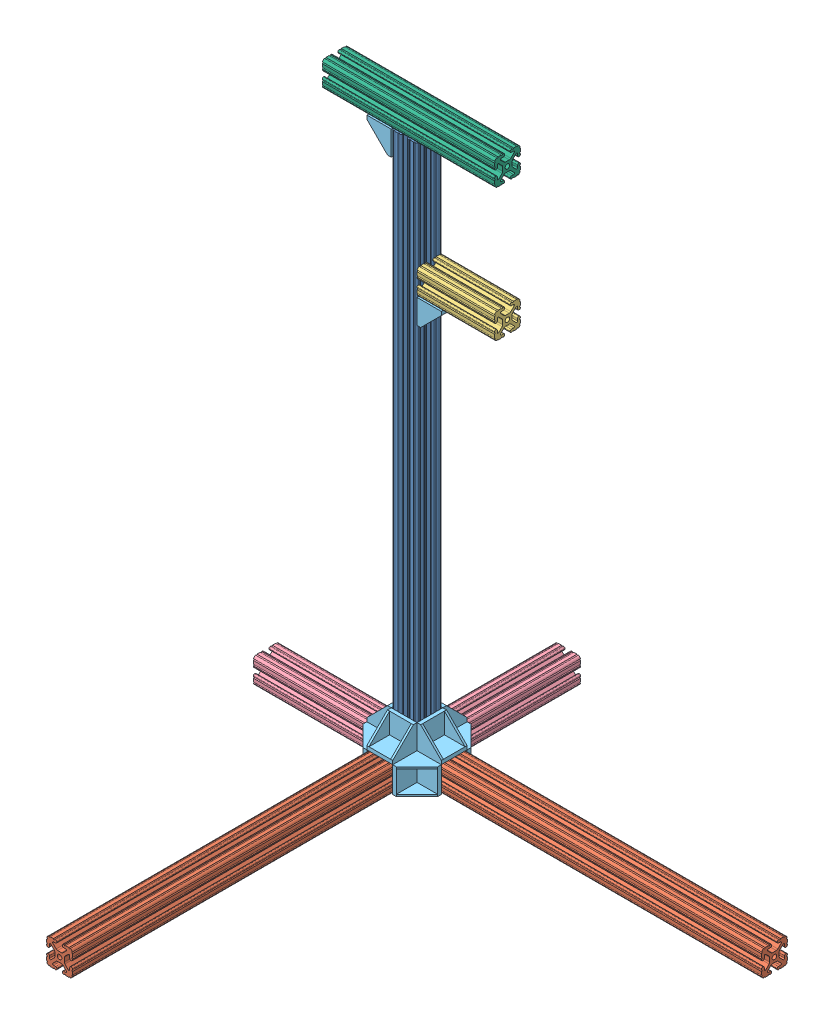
SolidWorks assembly Spine Assembly.SLDASM, configuration Default (file format 15000). Lengths in mm.
Overall size (749.3 850.9 749.3).
17 component instances, 6 part files, 59 mates.
Components (placement in the parent):
- 32in8020-1: 32in8020.SLDPRT [47065T415] at (-19.05 355.6 -19.05) x (1 0 0) z (0 -1 0) size (38.1 38.1 812.8)
- 20in8020-1: 20in8020.SLDPRT [47065T415] at (-19.05 19.05 457.2) size (38.1 38.1 508)
- 20in8020-2: 20in8020.SLDPRT [47065T415] at (50.8 19.05 -19.05) x (0 0 1) z (-1 0 0) size (38.1 38.1 508)
- 4.5in8020-3: 4.5in8020.SLDPRT [47065T415] at (-342.9 636.016 -19.05) x (0 0 1) z (-1 0 0) size (38.1 38.1 114.3)
- 8in8020-3: 8in8020.SLDPRT [47065T415] at (-19.05 19.05 215.9) size (38.1 38.1 203.2)
- 8in8020-4: 8in8020.SLDPRT [47065T415] at (215.9 19.05 -19.05) x (0 0 -1) z (1 0 0) size (38.1 38.1 203.2)
- Corner Support-1: Corner Support.SLDPRT [Default] at (0 616.966 0) x (0 0 -1) z (1 0 0) size (38.1 35.81 35.81)
- Corner Support-2: Corner Support.SLDPRT [Default] at (0 0 -38.1) x (0 1 0) z (1 0 0) size (38.1 35.81 35.81)
- Corner Support-3: Corner Support.SLDPRT [Default] at (-38.1 0 0) x (0 1 0) z (-1 0 0) size (38.1 35.81 35.81)
- Corner Support-4: Corner Support.SLDPRT [Default] x (0 1 0) z (0 0 1) size (38.1 35.81 35.81)
- Corner Support-5: Corner Support.SLDPRT [Default] at (0 38.1 -38.1) x (-1 0 0) z (0 1 0) size (38.1 35.81 35.81)
- Corner Support-6: Corner Support.SLDPRT [Default] at (0 38.1 0) x (0 0 -1) z (0 1 0) size (38.1 35.81 35.81)
- Corner Support-7: Corner Support.SLDPRT [Default] at (-38.1 38.1 0) x (1 0 0) z (0 1 0) size (38.1 35.81 35.81)
- Corner Support-8: Corner Support.SLDPRT [Default] at (-38.1 0 -38.1) x (0 1 0) z (0 0 -1) size (38.1 35.81 35.81)
- Corner Support-9: Corner Support.SLDPRT [Default] at (-38.1 38.1 -38.1) x (0 0 1) z (0 1 0) size (38.1 35.81 35.81)
- Corner Support-10: Corner Support.SLDPRT [Default] at (-38.1 812.8 -38.1) x (0 0 1) z (-1 0 0) size (38.1 35.81 35.81)
- 10in8020-1: 10in8020.SLDPRT [47065T415] at (317.5 831.85 -19.05) x (0 0 -1) z (1 0 0) size (38.1 38.1 254)
Mates (geometry in assembly coordinates):
- Coincident1: coincident aligned: plane of 32in8020-1 through (0 -101.6 -13.2588) normal (1 0 0)
- Coincident2: coincident aligned: plane of 32in8020-1 through (-24.8412 -101.6 0) normal (0 0 1)
- Coincident3: coincident anti-aligned: plane of 32in8020-1 through (-13.2588 0 -36.3728) normal (0 -1 0)
- Coincident4: coincident aligned: plane of 32in8020-1 through (-13.2588 0 -36.3728) normal (0 -1 0); plane of 20in8020-1 through (-13.2588 0 914.4) normal (0 -1 0)
- Coincident5: coincident aligned: plane of 20in8020-1 through (-13.2588 0 914.4) normal (0 -1 0); plane of 20in8020-2 through (-406.4 0 -13.2588) normal (0 -1 0)
- Coincident6: coincident anti-aligned: plane of 32in8020-1 through (-24.8412 -101.6 0) normal (0 0 1); plane of 20in8020-1 through (-13.2588 1.7272 0) normal (0 0 -1)
- Coincident7: coincident aligned: plane of 32in8020-1 through (0 -101.6 -13.2588) normal (1 0 0); plane of 20in8020-1 through (0 24.8412 914.4) normal (1 0 0)
- Coincident8: coincident anti-aligned: plane of 32in8020-1 through (0 -101.6 -24.8412) normal (1 0 0); plane of 20in8020-2 through (0 1.7272 -13.2588) normal (-1 0 0)
- Coincident9: coincident aligned: plane of 32in8020-1 through (-13.2588 -101.6 0) normal (0 0 1); plane of 20in8020-2 through (-406.4 24.8412 0) normal (0 0 1)
- Coincident10: coincident aligned: plane of 32in8020-1 through (-38.1 -101.6 -24.8412) normal (-1 0 0); plane of 4.5in8020-1 through (-38.1 24.8412 762) normal (-1 0 0)
- Coincident11: coincident anti-aligned: plane of 32in8020-1 through (-24.8412 -101.6 -38.1) normal (0 0 -1); plane of 4.5in8020-1 through (-13.2588 1.7272 -38.1) normal (0 0 1)
- Coincident12: coincident aligned: plane of 32in8020-1 through (-13.2588 0 -36.3728) normal (0 -1 0); plane of 4.5in8020-1 through (-24.8412 0 762) normal (0 -1 0)
- Coincident13: coincident aligned: plane of 32in8020-1 through (-13.2588 0 -36.3728) normal (0 -1 0); plane of 4.5in8020-2 through (762 0 -13.2588) normal (0 -1 0)
- Coincident14: coincident anti-aligned: plane of 32in8020-1 through (-38.1 -101.6 -24.8412) normal (-1 0 0); plane of 4.5in8020-2 through (-38.1 1.7272 -24.8412) normal (1 0 0)
- Coincident15: coincident aligned: plane of 32in8020-1 through (-24.8412 -101.6 0) normal (0 0 1); plane of 4.5in8020-2 through (762 24.8412 0) normal (0 0 1)
- Parallel1: parallel aligned: plane of 32in8020-1 through (-13.2588 812.8 -36.3728) normal (0 1 0); plane of 4.5in8020-3 through (-800.1 655.066 -24.8412) normal (0 1 0)
- Coincident20: coincident aligned: plane of 32in8020-1 through (-13.2588 0 -36.3728) normal (0 -1 0); plane of 8in8020-3 through (-13.2588 0 673.1) normal (0 -1 0)
- Coincident21: coincident anti-aligned: plane of 32in8020-1 through (-24.8412 -101.6 -38.1) normal (0 0 -1); plane of 8in8020-3 through (-13.2588 1.7272 -38.1) normal (0 0 1)
- Coincident22: coincident aligned: plane of 32in8020-1 through (-38.1 -101.6 -24.8412) normal (-1 0 0); plane of 8in8020-3 through (-38.1 24.8412 673.1) normal (-1 0 0)
- Coincident23: coincident anti-aligned: plane of 32in8020-1 through (-38.1 -101.6 -13.2588) normal (-1 0 0); plane of 8in8020-4 through (-38.1 1.7272 -24.8412) normal (1 0 0)
- Coincident24: coincident aligned: plane of 20in8020-1 through (-24.8412 38.1 914.4) normal (0 1 0); plane of 8in8020-4 through (673.1 38.1 -13.2588) normal (0 1 0)
- Coincident25: coincident aligned: plane of 32in8020-1 through (-24.8412 -101.6 0) normal (0 0 1); plane of 8in8020-4 through (673.1 24.8412 0) normal (0 0 1)
- Distance1: distance = 157.734 mm aligned: plane of 4.5in8020-3 through (-800.1 655.066 -24.8412) normal (0 1 0); plane of 32in8020-1 through (-13.2588 812.8 -36.3728) normal (0 1 0)
- Coincident27: coincident anti-aligned: plane of 32in8020-1 through (0 -101.6 -13.2588) normal (1 0 0); plane of 4.5in8020-3 through (0 618.6932 -13.2588) normal (-1 0 0)
- Coincident28: coincident aligned: plane of 32in8020-1 through (-13.2588 -101.6 0) normal (0 0 1); plane of 4.5in8020-3 through (-800.1 641.8072 0) normal (0 0 1)
- Coincident29: coincident anti-aligned: plane of 32in8020-1 through (0 -101.6 -24.8412) normal (1 0 0); plane of Corner Support-1 through (0 616.966 -38.1) normal (-1 0 0)
- Coincident30: coincident aligned: plane of 32in8020-1 through (-13.2588 -101.6 -38.1) normal (0 0 -1); plane of Corner Support-1 through (0 616.966 -38.1) normal (0 0 -1)
- Coincident31: coincident anti-aligned: plane of 4.5in8020-3 through (-800.1 616.966 -24.8412) normal (0 -1 0); plane of Corner Support-1 through (35.814 616.966 -38.1) normal (0 1 0)
- Coincident32: coincident aligned: plane of 20in8020-2 through (-406.4 38.1 -24.8412) normal (0 1 0); plane of Corner Support-2 through (0 38.1 -38.1) normal (0 1 0)
- Coincident33: coincident aligned: plane of Corner Support-2 through (0 38.1 -38.1) normal (0 1 0); plane of Corner Support-3 through (-38.1 38.1 0) normal (0 1 0)
- Coincident34: coincident aligned: plane of Corner Support-3 through (-38.1 38.1 0) normal (0 1 0); plane of Corner Support-4 through (0 38.1 0) normal (0 1 0)
- Coincident35: coincident aligned: plane of Corner Support-2 through (0 38.1 -38.1) normal (0 1 0); plane of Corner Support-8 through (-38.1 38.1 -38.1) normal (0 1 0)
- Coincident36: coincident anti-aligned: plane of 20in8020-1 through (-24.8412 38.1 914.4) normal (0 1 0); plane of Corner Support-7 through (0 38.1 0) normal (0 -1 0)
- Coincident37: coincident aligned: plane of 20in8020-1 through (0 24.8412 914.4) normal (1 0 0); plane of Corner Support-7 through (0 38.1 0) normal (1 0 0)
- Coincident38: coincident anti-aligned: plane of 20in8020-2 through (-406.4 38.1 -13.2588) normal (0 1 0); plane of Corner Support-6 through (0 38.1 -38.1) normal (0 -1 0)
- Coincident39: coincident aligned: plane of 32in8020-1 through (-13.2588 -101.6 -38.1) normal (0 0 -1); plane of Corner Support-6 through (0 38.1 -38.1) normal (0 0 -1)
- Coincident40: coincident anti-aligned: plane of 8in8020-3 through (-13.2588 38.1 673.1) normal (0 1 0); plane of Corner Support-5 through (-38.1 38.1 -38.1) normal (0 -1 0)
- Coincident41: coincident anti-aligned: plane of 32in8020-1 through (-13.2588 -101.6 -38.1) normal (0 0 -1); plane of Corner Support-5 through (-38.1 73.914 -38.1) normal (0 0 1)
- Coincident42: coincident aligned: plane of 8in8020-3 through (0 24.8412 673.1) normal (1 0 0); plane of Corner Support-5 through (0 38.1 -38.1) normal (1 0 0)
- Coincident43: coincident aligned: plane of 32in8020-1 through (-13.2588 -101.6 -38.1) normal (0 0 -1); plane of Corner Support-6 through (0 38.1 -38.1) normal (0 0 -1)
- Coincident44: coincident anti-aligned: plane of 8in8020-4 through (673.1 38.1 -24.8412) normal (0 1 0); plane of Corner Support-9 through (-38.1 38.1 0) normal (0 -1 0)
- Coincident45: coincident anti-aligned: plane of 32in8020-1 through (-38.1 -101.6 -24.8412) normal (-1 0 0); plane of Corner Support-9 through (-38.1 73.914 0) normal (1 0 0)
- Coincident46: coincident aligned: plane of 8in8020-4 through (673.1 24.8412 -38.1) normal (0 0 -1); plane of Corner Support-9 through (-38.1 38.1 -38.1) normal (0 0 -1)
- Coincident47: coincident anti-aligned: plane of 32in8020-1 through (-24.8412 -101.6 0) normal (0 0 1); plane of Corner Support-7 through (0 73.914 0) normal (0 0 -1)
- Coincident48: coincident anti-aligned: plane of 32in8020-1 through (0 -101.6 -13.2588) normal (1 0 0); plane of Corner Support-6 through (0 73.914 -38.1) normal (-1 0 0)
- Coincident49: coincident anti-aligned: plane of 8in8020-4 through (673.1 24.8412 0) normal (0 0 1); plane of Corner Support-3 through (-73.914 38.1 0) normal (0 0 -1)
- Coincident50: coincident anti-aligned: plane of 20in8020-1 through (-38.1 24.8412 914.4) normal (-1 0 0); plane of Corner Support-3 through (-38.1 38.1 0) normal (1 0 0)
- Coincident51: coincident anti-aligned: plane of 8in8020-3 through (-38.1 24.8412 673.1) normal (-1 0 0); plane of Corner Support-8 through (-38.1 38.1 -73.914) normal (1 0 0)
- Coincident52: coincident anti-aligned: plane of 8in8020-4 through (673.1 24.8412 -38.1) normal (0 0 -1); plane of Corner Support-8 through (-38.1 38.1 -38.1) normal (0 0 1)
- Coincident53: coincident anti-aligned: plane of 20in8020-2 through (-406.4 24.8412 -38.1) normal (0 0 -1); plane of Corner Support-2 through (35.814 38.1 -38.1) normal (0 0 1)
- Coincident54: coincident anti-aligned: plane of 8in8020-3 through (0 24.8412 673.1) normal (1 0 0); plane of Corner Support-2 through (0 38.1 -38.1) normal (-1 0 0)
- Coincident55: coincident anti-aligned: plane of 20in8020-2 through (-406.4 24.8412 0) normal (0 0 1); plane of Corner Support-4 through (0 38.1 0) normal (0 0 -1)
- Coincident56: coincident aligned: plane of Corner Support-4 through (35.814 38.1 0) normal (1 0 0); plane of Corner Support-6 through (35.814 38.1 -38.1) normal (1 0 0)
- Coincident57: coincident aligned: plane of 32in8020-1 through (-13.2588 812.8 -36.3728) normal (0 1 0); plane of Corner Support-10 through (-73.914 812.8 0) normal (0 1 0)
- Coincident58: coincident anti-aligned: plane of 32in8020-1 through (-38.1 -101.6 -13.2588) normal (-1 0 0); plane of Corner Support-10 through (-38.1 812.8 0) normal (1 0 0)
- Coincident59: coincident aligned: plane of 32in8020-1 through (-24.8412 -101.6 -38.1) normal (0 0 -1); plane of Corner Support-10 through (-38.1 812.8 -38.1) normal (0 0 -1)
- Coincident60: coincident: plane of Corner Support-10 through (-73.914 812.8 0) normal (0 1 0); plane of 10in8020-1 through (779.3455 806.671 -24.1532) normal (0 -1 0)
- Coincident62: coincident: plane of 4.5in8020-3 through (114.3 618.6932 -13.2588) normal (1 0 0); plane of 10in8020-1 through (114.3 814.5272 -24.8412) normal (1 0 0)
- Coincident63: coincident aligned: plane of 32in8020-1 through (-13.2588 -101.6 0) normal (0 0 1); plane of 10in8020-1 through (774.7 826.0588 0) normal (0 0 1)
